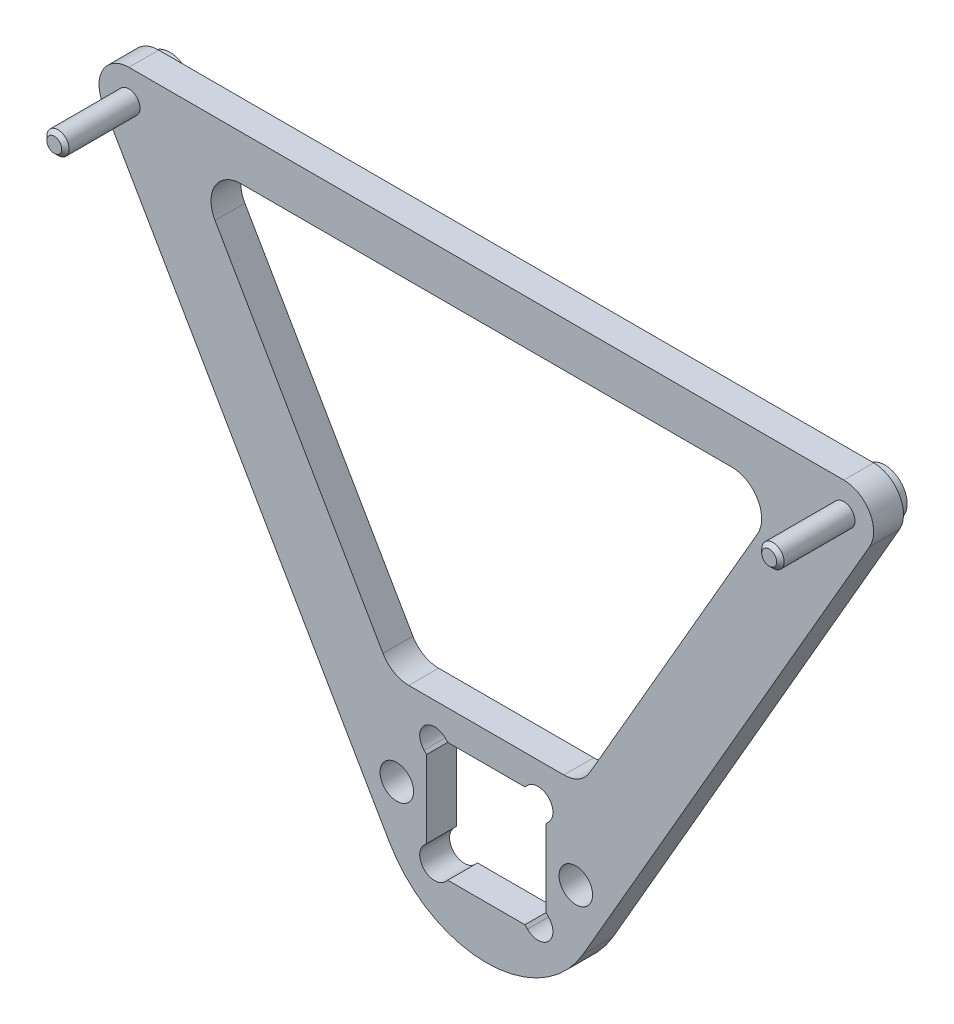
from build123d import *

# Parameters (mm, degrees)
ESQUISSE1_R        = 2.25
BOSS_EXTRU_1_DEPTH = 2
ESQUISSE2_R        = 1.5
BOSS_EXTRU_2_DEPTH = 10
ESQUISSE3_R        = 3
BOSS_EXTRU_3_DEPTH = 1.5
CHANFREIN1_SIZE    = 0.5


with BuildPart() as part:
    # Esquisse1 → Boss.-Extru.1 (new, symmetric)
    with BuildSketch(Plane.XY):
        with BuildLine():
            Line((12.990381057, -7.5), (51.384173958, 59))
            ThreePointArc((51.384173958, 59), (51.384173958, 63), (47.920072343, 65))
            Line((47.920072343, 65), (-47.920072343, 65))
            ThreePointArc((-47.920072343, 65), (-51.384173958, 63), (-51.384173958, 59))
            Line((-51.384173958, 59), (-12.990381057, -7.5))
            ThreePointArc((-12.990381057, -7.5), (0, -15), (12.990381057, -7.5))
        make_face()
        with Locations((-12, 0)):
            Circle(ESQUISSE1_R, mode=Mode.SUBTRACT)
        with Locations((12, 0)):
            Circle(ESQUISSE1_R, mode=Mode.SUBTRACT)
        with BuildLine():
            Line((-5.171572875, 8), (5.171572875, 8))
            Line((5.171572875, 8), (5.515432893, 8.343860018))
            ThreePointArc((5.515432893, 8.343860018), (8.343860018, 8.343860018), (8.343860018, 5.515432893))
            Line((8.343860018, 5.515432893), (8, 5.171572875))
            Line((8, 5.171572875), (8, -5.171572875))
            Line((8, -5.171572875), (8.343860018, -5.515432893))
            ThreePointArc((8.343860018, -5.515432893), (8.343860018, -8.343860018), (5.515432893, -8.343860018))
            Line((5.515432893, -8.343860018), (5.171572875, -8))
            Line((5.171572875, -8), (-5.171572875, -8))
            Line((-5.171572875, -8), (-5.515432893, -8.343860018))
            ThreePointArc((-5.515432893, -8.343860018), (-8.343860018, -8.343860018), (-8.343860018, -5.515432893))
            Line((-8.343860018, -5.515432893), (-8, -5.171572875))
            Line((-8, -5.171572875), (-8, 5.171572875))
            Line((-8, 5.171572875), (-8.343860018, 5.515432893))
            ThreePointArc((-8.343860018, 5.515432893), (-8.343860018, 8.343860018), (-5.515432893, 8.343860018))
            Line((-5.515432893, 8.343860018), (-5.171572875, 8))
        make_face(mode=Mode.SUBTRACT)
        with BuildLine():
            Line((-13.856406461, 14), (-36.373066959, 53))
            ThreePointArc((-36.373066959, 53), (-36.373066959, 57), (-32.908965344, 59))
            Line((-32.908965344, 59), (32.908965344, 59))
            ThreePointArc((32.908965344, 59), (36.373066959, 57), (36.373066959, 53))
            Line((36.373066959, 53), (13.856406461, 14))
            ThreePointArc((13.856406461, 14), (12.392304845, 12.535898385), (10.392304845, 12))
            Line((10.392304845, 12), (-10.392304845, 12))
            ThreePointArc((-10.392304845, 12), (-12.392304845, 12.535898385), (-13.856406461, 14))
        make_face(mode=Mode.SUBTRACT)
    extrude(amount=BOSS_EXTRU_1_DEPTH, both=True)

    # Esquisse2 → Boss.-Extru.2 (add)
    with BuildSketch(Plane.XY.offset(2)):
        with Locations((-47.920072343, 61)):
            Circle(ESQUISSE2_R)
        with Locations((47.920072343, 61)):
            Circle(ESQUISSE2_R)
    extrude(amount=BOSS_EXTRU_2_DEPTH)

    # Esquisse3 → Boss.-Extru.3 (add)
    with BuildSketch(Plane(origin=(0, 0, -2), x_dir=(-1, 0, 0), z_dir=(0, 0, -1))):
        with Locations(Location((-47.920072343, 61, 0), (0, 0, 180))):
            Circle(ESQUISSE3_R)
        with Locations(Location((47.920072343, 61, 0), (0, 0, 180))):
            Circle(ESQUISSE3_R)
    extrude(amount=BOSS_EXTRU_3_DEPTH)

    # Chanfrein1
    chanfrein1_edges = [part.edges().sort_by_distance(p)[0] for p in [
        (-49.420072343, 61, 12),
        (46.420072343, 61, 12),
    ]]
    chamfer(chanfrein1_edges, length=CHANFREIN1_SIZE)


solid = part.part
